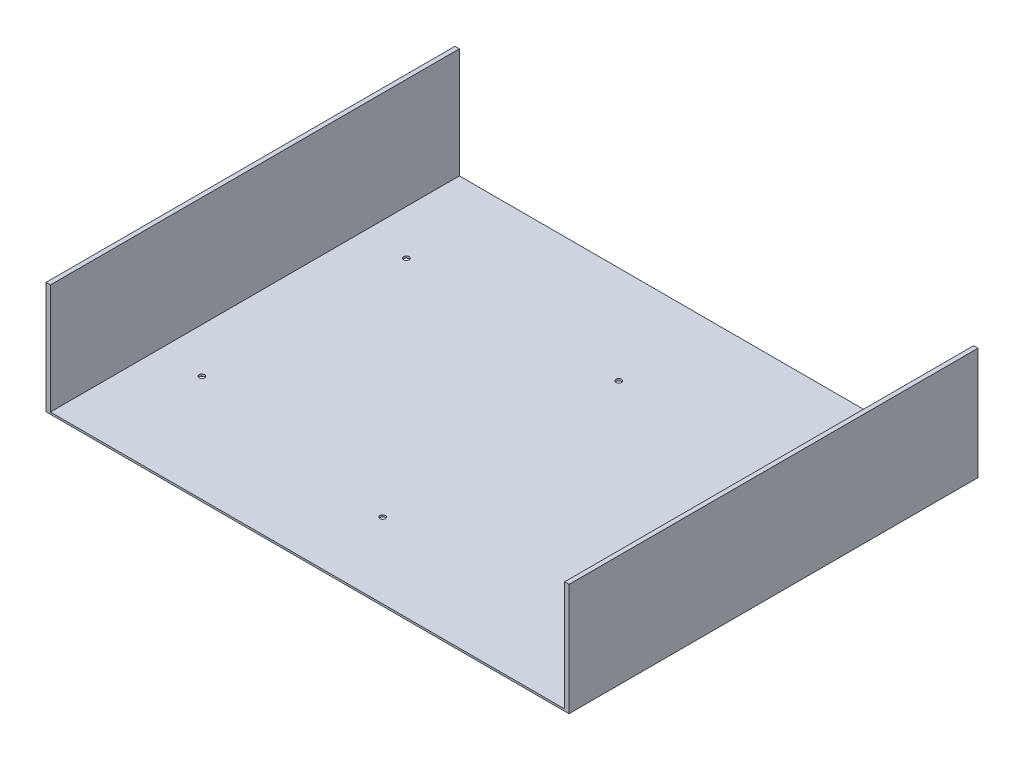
from build123d import *

# Parameters (mm, degrees)
SKETCH1_W             = 422.275
SKETCH1_H             = 330.2
BOSS_EXTRUDE1_DEPTH   = 1.5875
SKETCH2_W             = 3.556
SKETCH2_H             = 330.2
BOSS_EXTRUDE2_DEPTH   = 88.9
F_8_CLEARANCE_HOLE1_D = 4.4958


with BuildPart() as part:
    # Sketch1 → Boss-Extrude1 (new body)
    with BuildSketch(Plane(origin=(0, 0, 0), x_dir=(1, 0, 0), z_dir=(0, 1, 0))):
        with Locations((211.1375, 165.1)):
            Rectangle(SKETCH1_W, SKETCH1_H)
    extrude(amount=BOSS_EXTRUDE1_DEPTH)

    # Sketch2 → Boss-Extrude2 (add)
    with BuildSketch(Plane(origin=(0, 1.5875, 0), x_dir=(1, 0, 0), z_dir=(0, 1, 0))):
        with Locations((1.778, 165.1)):
            Rectangle(SKETCH2_W, SKETCH2_H)
        with Locations((420.497, 165.1)):
            Rectangle(SKETCH2_W, SKETCH2_H)
    extrude(amount=BOSS_EXTRUDE2_DEPTH)

    # 8 Clearance Hole1 (through all)
    with Locations(Plane(origin=(0, 1.5875, 0), x_dir=(1, 0, 0), z_dir=(0, 1, 0))):
        with Locations((39.6875, 251.2822), (211.1375, 251.2822), (382.5875, 251.2822), (382.5875, 60.7822), (211.1375, 60.7822), (39.6875, 86.1822)):
            Hole(F_8_CLEARANCE_HOLE1_D / 2)


solid = part.part
